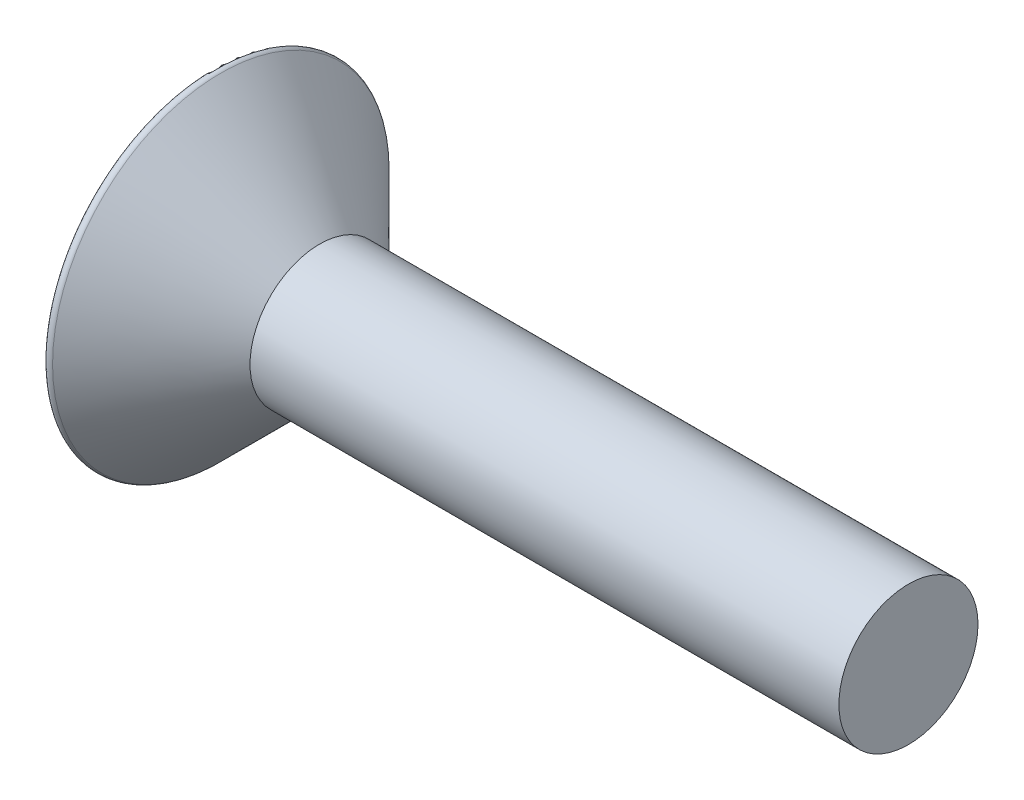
ISO-10303-21;
HEADER;
FILE_DESCRIPTION(('STEP AP214'),'2;1');
FILE_NAME('part.step','',(''),(''),'','','');
FILE_SCHEMA(('AUTOMOTIVE_DESIGN { 1 0 10303 214 1 1 1 1 }'));
ENDSEC;
DATA;
#1=APPLICATION_CONTEXT('core data for automotive mechanical design processes');
#2=APPLICATION_PROTOCOL_DEFINITION('international standard','automotive_design',2000,#1);
#3=PRODUCT_CONTEXT('',#1,'mechanical');
#4=PRODUCT('Part','Part','',(#3));
#5=PRODUCT_RELATED_PRODUCT_CATEGORY('part','',(#4));
#6=PRODUCT_DEFINITION_FORMATION('','',#4);
#7=PRODUCT_DEFINITION_CONTEXT('part definition',#1,'design');
#8=PRODUCT_DEFINITION('design','',#6,#7);
#9=PRODUCT_DEFINITION_SHAPE('','',#8);
#10=(LENGTH_UNIT() NAMED_UNIT(*) SI_UNIT(.MILLI.,.METRE.));
#11=(NAMED_UNIT(*) PLANE_ANGLE_UNIT() SI_UNIT($,.RADIAN.));
#12=(NAMED_UNIT(*) SI_UNIT($,.STERADIAN.) SOLID_ANGLE_UNIT());
#13=UNCERTAINTY_MEASURE_WITH_UNIT(LENGTH_MEASURE(1.E-05),#10,'distance_accuracy_value','');
#14=(GEOMETRIC_REPRESENTATION_CONTEXT(3) GLOBAL_UNCERTAINTY_ASSIGNED_CONTEXT((#13)) GLOBAL_UNIT_ASSIGNED_CONTEXT((#10,
#11,#12)) REPRESENTATION_CONTEXT('',''));
#15=CARTESIAN_POINT('',(0.,0.,0.));
#16=DIRECTION('',(0.,0.,1.));
#17=DIRECTION('',(1.,0.,0.));
#18=AXIS2_PLACEMENT_3D('',#15,#16,#17);
#19=CARTESIAN_POINT('',(0.,0.,0.));
#20=DIRECTION('',(1.,0.,0.));
#21=DIRECTION('',(0.,0.,-1.));
#22=AXIS2_PLACEMENT_3D('',#19,#20,#21);
#23=PLANE('',#22);
#24=CARTESIAN_POINT('',(0.,0.,0.));
#25=DIRECTION('',(1.,0.,0.));
#26=DIRECTION('',(0.,0.,-1.));
#27=AXIS2_PLACEMENT_3D('',#24,#25,#26);
#28=CIRCLE('',#27,7.1171572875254);
#29=CARTESIAN_POINT('',(0.,0.,-7.1171572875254));
#30=VERTEX_POINT('',#29);
#31=EDGE_CURVE('E11',#30,#30,#28,.F.);
#32=ORIENTED_EDGE('',*,*,#31,.T.);
#33=EDGE_LOOP('',(#32));
#34=FACE_BOUND('',#33,.T.);
#35=DIRECTION('',(0.,0.866025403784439,-0.5));
#36=VECTOR('',#35,1.);
#37=CARTESIAN_POINT('',(0.,-2.075,-1.19800180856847));
#38=LINE('',#37,#36);
#39=CARTESIAN_POINT('',(0.,-2.075,-1.19800180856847));
#40=VERTEX_POINT('',#39);
#41=CARTESIAN_POINT('',(0.,0.,-2.39600361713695));
#42=VERTEX_POINT('',#41);
#43=EDGE_CURVE('E52',#40,#42,#38,.T.);
#44=ORIENTED_EDGE('',*,*,#43,.T.);
#45=DIRECTION('',(0.,0.866025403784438,0.5));
#46=VECTOR('',#45,1.);
#47=CARTESIAN_POINT('',(0.,0.,-2.39600361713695));
#48=LINE('',#47,#46);
#49=CARTESIAN_POINT('',(0.,2.075,-1.19800180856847));
#50=VERTEX_POINT('',#49);
#51=EDGE_CURVE('E111',#42,#50,#48,.T.);
#52=ORIENTED_EDGE('',*,*,#51,.T.);
#53=DIRECTION('',(0.,0.,1.));
#54=VECTOR('',#53,1.);
#55=CARTESIAN_POINT('',(0.,2.075,-1.19800180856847));
#56=LINE('',#55,#54);
#57=CARTESIAN_POINT('',(0.,2.075,1.19800180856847));
#58=VERTEX_POINT('',#57);
#59=EDGE_CURVE('E109',#50,#58,#56,.T.);
#60=ORIENTED_EDGE('',*,*,#59,.T.);
#61=DIRECTION('',(0.,-0.866025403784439,0.5));
#62=VECTOR('',#61,1.);
#63=CARTESIAN_POINT('',(0.,2.075,1.19800180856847));
#64=LINE('',#63,#62);
#65=CARTESIAN_POINT('',(0.,0.,2.39600361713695));
#66=VERTEX_POINT('',#65);
#67=EDGE_CURVE('E88',#58,#66,#64,.T.);
#68=ORIENTED_EDGE('',*,*,#67,.T.);
#69=DIRECTION('',(0.,-0.866025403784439,-0.5));
#70=VECTOR('',#69,1.);
#71=CARTESIAN_POINT('',(0.,0.,2.39600361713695));
#72=LINE('',#71,#70);
#73=CARTESIAN_POINT('',(0.,-2.075,1.19800180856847));
#74=VERTEX_POINT('',#73);
#75=EDGE_CURVE('E99',#66,#74,#72,.T.);
#76=ORIENTED_EDGE('',*,*,#75,.T.);
#77=DIRECTION('',(0.,0.,-1.));
#78=VECTOR('',#77,1.);
#79=CARTESIAN_POINT('',(0.,-2.075,1.19800180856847));
#80=LINE('',#79,#78);
#81=EDGE_CURVE('E105',#74,#40,#80,.T.);
#82=ORIENTED_EDGE('',*,*,#81,.T.);
#83=EDGE_LOOP('',(#44,#52,#60,#68,#76,#82));
#84=FACE_BOUND('',#83,.T.);
#85=ADVANCED_FACE('F37',(#34,#84),#23,.F.);
#86=CARTESIAN_POINT('',(34.6,0.,0.));
#87=DIRECTION('',(-1.,0.,0.));
#88=DIRECTION('',(0.,0.,1.));
#89=AXIS2_PLACEMENT_3D('',#86,#87,#88);
#90=CYLINDRICAL_SURFACE('',#89,3.);
#91=CARTESIAN_POINT('',(4.6,0.,0.));
#92=DIRECTION('',(1.,0.,0.));
#93=DIRECTION('',(0.,0.,-1.));
#94=AXIS2_PLACEMENT_3D('',#91,#92,#93);
#95=CIRCLE('',#94,3.);
#96=CARTESIAN_POINT('',(4.6,0.,-3.));
#97=VERTEX_POINT('',#96);
#98=EDGE_CURVE('E126',#97,#97,#95,.T.);
#99=ORIENTED_EDGE('',*,*,#98,.T.);
#100=EDGE_LOOP('',(#99));
#101=FACE_BOUND('',#100,.T.);
#102=CARTESIAN_POINT('',(30.,0.,0.));
#103=DIRECTION('',(1.,0.,0.));
#104=DIRECTION('',(0.,0.,-1.));
#105=AXIS2_PLACEMENT_3D('',#102,#103,#104);
#106=CIRCLE('',#105,3.);
#107=CARTESIAN_POINT('',(30.,0.,-3.));
#108=VERTEX_POINT('',#107);
#109=EDGE_CURVE('E130',#108,#108,#106,.T.);
#110=ORIENTED_EDGE('',*,*,#109,.F.);
#111=EDGE_LOOP('',(#110));
#112=FACE_BOUND('',#111,.T.);
#113=ADVANCED_FACE('F149',(#101,#112),#90,.T.);
#114=CARTESIAN_POINT('',(4.6,0.,0.));
#115=DIRECTION('',(-1.,0.,0.));
#116=DIRECTION('',(0.,0.,-1.));
#117=AXIS2_PLACEMENT_3D('',#114,#115,#116);
#118=CONICAL_SURFACE('',#117,3.,0.78539816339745);
#119=CARTESIAN_POINT('',(0.341421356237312,0.,0.));
#120=DIRECTION('',(-1.,0.,0.));
#121=DIRECTION('',(0.,0.,1.));
#122=AXIS2_PLACEMENT_3D('',#119,#120,#121);
#123=CIRCLE('',#122,7.25857864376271);
#124=CARTESIAN_POINT('',(0.341421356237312,0.,7.25857864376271));
#125=VERTEX_POINT('',#124);
#126=EDGE_CURVE('E45',#125,#125,#123,.F.);
#127=ORIENTED_EDGE('',*,*,#126,.T.);
#128=EDGE_LOOP('',(#127));
#129=FACE_BOUND('',#128,.T.);
#130=ORIENTED_EDGE('',*,*,#98,.F.);
#131=EDGE_LOOP('',(#130));
#132=FACE_BOUND('',#131,.T.);
#133=ADVANCED_FACE('F135',(#129,#132),#118,.T.);
#134=CARTESIAN_POINT('',(30.,6.,60.4172122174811));
#135=DIRECTION('',(1.,0.,0.));
#136=DIRECTION('',(0.,0.,-1.));
#137=AXIS2_PLACEMENT_3D('',#134,#135,#136);
#138=PLANE('',#137);
#139=ORIENTED_EDGE('',*,*,#109,.T.);
#140=EDGE_LOOP('',(#139));
#141=FACE_BOUND('',#140,.T.);
#142=ADVANCED_FACE('F159',(#141),#138,.T.);
#143=CARTESIAN_POINT('',(2.,-2.075,-1.19800180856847));
#144=DIRECTION('',(0.,0.5,0.866025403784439));
#145=DIRECTION('',(0.,-0.866025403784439,0.5));
#146=AXIS2_PLACEMENT_3D('',#143,#144,#145);
#147=PLANE('',#146);
#148=ORIENTED_EDGE('',*,*,#43,.F.);
#149=DIRECTION('',(-1.,0.,0.));
#150=VECTOR('',#149,1.);
#151=CARTESIAN_POINT('',(2.,-2.075,-1.19800180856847));
#152=LINE('',#151,#150);
#153=CARTESIAN_POINT('',(2.,-2.075,-1.19800180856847));
#154=VERTEX_POINT('',#153);
#155=EDGE_CURVE('E117',#154,#40,#152,.T.);
#156=ORIENTED_EDGE('',*,*,#155,.F.);
#157=DIRECTION('',(0.,0.866025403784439,-0.5));
#158=VECTOR('',#157,1.);
#159=CARTESIAN_POINT('',(2.,-2.075,-1.19800180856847));
#160=LINE('',#159,#158);
#161=CARTESIAN_POINT('',(2.,0.,-2.39600361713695));
#162=VERTEX_POINT('',#161);
#163=EDGE_CURVE('E116',#154,#162,#160,.T.);
#164=ORIENTED_EDGE('',*,*,#163,.T.);
#165=DIRECTION('',(-1.,0.,0.));
#166=VECTOR('',#165,1.);
#167=CARTESIAN_POINT('',(2.,0.,-2.39600361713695));
#168=LINE('',#167,#166);
#169=EDGE_CURVE('E124',#162,#42,#168,.T.);
#170=ORIENTED_EDGE('',*,*,#169,.T.);
#171=EDGE_LOOP('',(#148,#156,#164,#170));
#172=FACE_BOUND('',#171,.T.);
#173=ADVANCED_FACE('F163',(#172),#147,.T.);
#174=CARTESIAN_POINT('',(2.,0.,-2.39600361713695));
#175=DIRECTION('',(0.,-0.5,0.866025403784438));
#176=DIRECTION('',(0.,-0.866025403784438,-0.5));
#177=AXIS2_PLACEMENT_3D('',#174,#175,#176);
#178=PLANE('',#177);
#179=ORIENTED_EDGE('',*,*,#51,.F.);
#180=ORIENTED_EDGE('',*,*,#169,.F.);
#181=DIRECTION('',(0.,0.866025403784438,0.5));
#182=VECTOR('',#181,1.);
#183=CARTESIAN_POINT('',(2.,0.,-2.39600361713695));
#184=LINE('',#183,#182);
#185=CARTESIAN_POINT('',(2.,2.075,-1.19800180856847));
#186=VERTEX_POINT('',#185);
#187=EDGE_CURVE('E209',#162,#186,#184,.T.);
#188=ORIENTED_EDGE('',*,*,#187,.T.);
#189=DIRECTION('',(-1.,0.,0.));
#190=VECTOR('',#189,1.);
#191=CARTESIAN_POINT('',(2.,2.075,-1.19800180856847));
#192=LINE('',#191,#190);
#193=EDGE_CURVE('E122',#186,#50,#192,.T.);
#194=ORIENTED_EDGE('',*,*,#193,.T.);
#195=EDGE_LOOP('',(#179,#180,#188,#194));
#196=FACE_BOUND('',#195,.T.);
#197=ADVANCED_FACE('F168',(#196),#178,.T.);
#198=CARTESIAN_POINT('',(2.,2.075,-1.19800180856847));
#199=DIRECTION('',(0.,-1.,0.));
#200=DIRECTION('',(0.,0.,-1.));
#201=AXIS2_PLACEMENT_3D('',#198,#199,#200);
#202=PLANE('',#201);
#203=ORIENTED_EDGE('',*,*,#59,.F.);
#204=ORIENTED_EDGE('',*,*,#193,.F.);
#205=DIRECTION('',(0.,0.,1.));
#206=VECTOR('',#205,1.);
#207=CARTESIAN_POINT('',(2.,2.075,-1.19800180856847));
#208=LINE('',#207,#206);
#209=CARTESIAN_POINT('',(2.,2.075,1.19800180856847));
#210=VERTEX_POINT('',#209);
#211=EDGE_CURVE('E61',#186,#210,#208,.T.);
#212=ORIENTED_EDGE('',*,*,#211,.T.);
#213=DIRECTION('',(-1.,0.,0.));
#214=VECTOR('',#213,1.);
#215=CARTESIAN_POINT('',(2.,2.075,1.19800180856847));
#216=LINE('',#215,#214);
#217=EDGE_CURVE('E95',#210,#58,#216,.T.);
#218=ORIENTED_EDGE('',*,*,#217,.T.);
#219=EDGE_LOOP('',(#203,#204,#212,#218));
#220=FACE_BOUND('',#219,.T.);
#221=ADVANCED_FACE('F173',(#220),#202,.T.);
#222=CARTESIAN_POINT('',(2.,2.075,1.19800180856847));
#223=DIRECTION('',(0.,-0.5,-0.866025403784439));
#224=DIRECTION('',(0.,0.866025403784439,-0.5));
#225=AXIS2_PLACEMENT_3D('',#222,#223,#224);
#226=PLANE('',#225);
#227=ORIENTED_EDGE('',*,*,#67,.F.);
#228=ORIENTED_EDGE('',*,*,#217,.F.);
#229=DIRECTION('',(0.,-0.866025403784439,0.5));
#230=VECTOR('',#229,1.);
#231=CARTESIAN_POINT('',(2.,2.075,1.19800180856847));
#232=LINE('',#231,#230);
#233=CARTESIAN_POINT('',(2.,0.,2.39600361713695));
#234=VERTEX_POINT('',#233);
#235=EDGE_CURVE('E92',#210,#234,#232,.T.);
#236=ORIENTED_EDGE('',*,*,#235,.T.);
#237=DIRECTION('',(-1.,0.,0.));
#238=VECTOR('',#237,1.);
#239=CARTESIAN_POINT('',(2.,0.,2.39600361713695));
#240=LINE('',#239,#238);
#241=EDGE_CURVE('E83',#234,#66,#240,.T.);
#242=ORIENTED_EDGE('',*,*,#241,.T.);
#243=EDGE_LOOP('',(#227,#228,#236,#242));
#244=FACE_BOUND('',#243,.T.);
#245=ADVANCED_FACE('F85',(#244),#226,.T.);
#246=CARTESIAN_POINT('',(2.,0.,2.39600361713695));
#247=DIRECTION('',(0.,0.5,-0.866025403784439));
#248=DIRECTION('',(0.,0.866025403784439,0.5));
#249=AXIS2_PLACEMENT_3D('',#246,#247,#248);
#250=PLANE('',#249);
#251=ORIENTED_EDGE('',*,*,#75,.F.);
#252=ORIENTED_EDGE('',*,*,#241,.F.);
#253=DIRECTION('',(0.,-0.866025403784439,-0.5));
#254=VECTOR('',#253,1.);
#255=CARTESIAN_POINT('',(2.,0.,2.39600361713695));
#256=LINE('',#255,#254);
#257=CARTESIAN_POINT('',(2.,-2.075,1.19800180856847));
#258=VERTEX_POINT('',#257);
#259=EDGE_CURVE('E226',#234,#258,#256,.T.);
#260=ORIENTED_EDGE('',*,*,#259,.T.);
#261=DIRECTION('',(-1.,0.,0.));
#262=VECTOR('',#261,1.);
#263=CARTESIAN_POINT('',(2.,-2.075,1.19800180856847));
#264=LINE('',#263,#262);
#265=EDGE_CURVE('E96',#258,#74,#264,.T.);
#266=ORIENTED_EDGE('',*,*,#265,.T.);
#267=EDGE_LOOP('',(#251,#252,#260,#266));
#268=FACE_BOUND('',#267,.T.);
#269=ADVANCED_FACE('F100',(#268),#250,.T.);
#270=CARTESIAN_POINT('',(2.,-2.075,1.19800180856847));
#271=DIRECTION('',(0.,1.,0.));
#272=DIRECTION('',(0.,0.,1.));
#273=AXIS2_PLACEMENT_3D('',#270,#271,#272);
#274=PLANE('',#273);
#275=ORIENTED_EDGE('',*,*,#81,.F.);
#276=ORIENTED_EDGE('',*,*,#265,.F.);
#277=DIRECTION('',(0.,0.,-1.));
#278=VECTOR('',#277,1.);
#279=CARTESIAN_POINT('',(2.,-2.075,1.19800180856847));
#280=LINE('',#279,#278);
#281=EDGE_CURVE('E119',#258,#154,#280,.T.);
#282=ORIENTED_EDGE('',*,*,#281,.T.);
#283=ORIENTED_EDGE('',*,*,#155,.T.);
#284=EDGE_LOOP('',(#275,#276,#282,#283));
#285=FACE_BOUND('',#284,.T.);
#286=ADVANCED_FACE('F182',(#285),#274,.T.);
#287=CARTESIAN_POINT('',(2.,0.,-2.39600361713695));
#288=DIRECTION('',(0.86602540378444,0.249999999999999,-0.433012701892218));
#289=DIRECTION('',(-0.447213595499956,0.,-0.894427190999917));
#290=AXIS2_PLACEMENT_3D('',#287,#288,#289);
#291=PLANE('',#290);
#292=ORIENTED_EDGE('',*,*,#187,.F.);
#293=DIRECTION('',(-0.447213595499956,0.,-0.894427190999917));
#294=VECTOR('',#293,1.);
#295=CARTESIAN_POINT('',(2.,0.,-2.39600361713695));
#296=LINE('',#295,#294);
#297=CARTESIAN_POINT('',(3.19800180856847,0.,0.));
#298=VERTEX_POINT('',#297);
#299=EDGE_CURVE('E212',#298,#162,#296,.T.);
#300=ORIENTED_EDGE('',*,*,#299,.F.);
#301=DIRECTION('',(-0.447213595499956,0.774596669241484,-0.447213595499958));
#302=VECTOR('',#301,1.);
#303=CARTESIAN_POINT('',(2.,2.075,-1.19800180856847));
#304=LINE('',#303,#302);
#305=EDGE_CURVE('E213',#298,#186,#304,.T.);
#306=ORIENTED_EDGE('',*,*,#305,.T.);
#307=EDGE_LOOP('',(#292,#300,#306));
#308=FACE_BOUND('',#307,.T.);
#309=ADVANCED_FACE('F185',(#308),#291,.F.);
#310=CARTESIAN_POINT('',(2.,2.075,-1.19800180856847));
#311=DIRECTION('',(0.86602540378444,0.499999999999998,0.));
#312=DIRECTION('',(-0.499999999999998,0.86602540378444,0.));
#313=AXIS2_PLACEMENT_3D('',#310,#311,#312);
#314=PLANE('',#313);
#315=ORIENTED_EDGE('',*,*,#211,.F.);
#316=ORIENTED_EDGE('',*,*,#305,.F.);
#317=DIRECTION('',(-0.447213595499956,0.774596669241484,0.447213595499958));
#318=VECTOR('',#317,1.);
#319=CARTESIAN_POINT('',(2.,2.075,1.19800180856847));
#320=LINE('',#319,#318);
#321=EDGE_CURVE('E230',#298,#210,#320,.T.);
#322=ORIENTED_EDGE('',*,*,#321,.T.);
#323=EDGE_LOOP('',(#315,#316,#322));
#324=FACE_BOUND('',#323,.T.);
#325=ADVANCED_FACE('F187',(#324),#314,.F.);
#326=CARTESIAN_POINT('',(2.,2.075,1.19800180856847));
#327=DIRECTION('',(0.86602540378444,0.249999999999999,0.433012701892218));
#328=DIRECTION('',(0.447213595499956,0.,-0.894427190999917));
#329=AXIS2_PLACEMENT_3D('',#326,#327,#328);
#330=PLANE('',#329);
#331=ORIENTED_EDGE('',*,*,#235,.F.);
#332=ORIENTED_EDGE('',*,*,#321,.F.);
#333=DIRECTION('',(-0.447213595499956,0.,0.894427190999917));
#334=VECTOR('',#333,1.);
#335=CARTESIAN_POINT('',(2.,0.,2.39600361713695));
#336=LINE('',#335,#334);
#337=EDGE_CURVE('E232',#298,#234,#336,.T.);
#338=ORIENTED_EDGE('',*,*,#337,.T.);
#339=EDGE_LOOP('',(#331,#332,#338));
#340=FACE_BOUND('',#339,.T.);
#341=ADVANCED_FACE('F190',(#340),#330,.F.);
#342=CARTESIAN_POINT('',(2.,0.,2.39600361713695));
#343=DIRECTION('',(0.86602540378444,-0.249999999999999,0.433012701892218));
#344=DIRECTION('',(0.447213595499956,0.,-0.894427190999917));
#345=AXIS2_PLACEMENT_3D('',#342,#343,#344);
#346=PLANE('',#345);
#347=ORIENTED_EDGE('',*,*,#259,.F.);
#348=ORIENTED_EDGE('',*,*,#337,.F.);
#349=DIRECTION('',(-0.447213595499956,-0.774596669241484,0.447213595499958));
#350=VECTOR('',#349,1.);
#351=CARTESIAN_POINT('',(2.,-2.075,1.19800180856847));
#352=LINE('',#351,#350);
#353=EDGE_CURVE('E235',#298,#258,#352,.T.);
#354=ORIENTED_EDGE('',*,*,#353,.T.);
#355=EDGE_LOOP('',(#347,#348,#354));
#356=FACE_BOUND('',#355,.T.);
#357=ADVANCED_FACE('F193',(#356),#346,.F.);
#358=CARTESIAN_POINT('',(2.,-2.075,1.19800180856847));
#359=DIRECTION('',(0.86602540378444,-0.499999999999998,0.));
#360=DIRECTION('',(0.499999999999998,0.86602540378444,0.));
#361=AXIS2_PLACEMENT_3D('',#358,#359,#360);
#362=PLANE('',#361);
#363=ORIENTED_EDGE('',*,*,#281,.F.);
#364=ORIENTED_EDGE('',*,*,#353,.F.);
#365=DIRECTION('',(-0.447213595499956,-0.774596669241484,-0.447213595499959));
#366=VECTOR('',#365,1.);
#367=CARTESIAN_POINT('',(2.,-2.075,-1.19800180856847));
#368=LINE('',#367,#366);
#369=EDGE_CURVE('E238',#298,#154,#368,.T.);
#370=ORIENTED_EDGE('',*,*,#369,.T.);
#371=EDGE_LOOP('',(#363,#364,#370));
#372=FACE_BOUND('',#371,.T.);
#373=ADVANCED_FACE('F144',(#372),#362,.F.);
#374=CARTESIAN_POINT('',(2.,-2.075,-1.19800180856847));
#375=DIRECTION('',(0.86602540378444,-0.249999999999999,-0.433012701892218));
#376=DIRECTION('',(-0.447213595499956,0.,-0.894427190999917));
#377=AXIS2_PLACEMENT_3D('',#374,#375,#376);
#378=PLANE('',#377);
#379=ORIENTED_EDGE('',*,*,#163,.F.);
#380=ORIENTED_EDGE('',*,*,#369,.F.);
#381=ORIENTED_EDGE('',*,*,#299,.T.);
#382=EDGE_LOOP('',(#379,#380,#381));
#383=FACE_BOUND('',#382,.T.);
#384=ADVANCED_FACE('F139',(#383),#378,.F.);
#385=CARTESIAN_POINT('',(0.2,0.,0.));
#386=DIRECTION('',(1.,0.,0.));
#387=DIRECTION('',(0.,0.,-1.));
#388=AXIS2_PLACEMENT_3D('',#385,#386,#387);
#389=TOROIDAL_SURFACE('',#388,7.1171572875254,0.2);
#390=ORIENTED_EDGE('',*,*,#31,.F.);
#391=EDGE_LOOP('',(#390));
#392=FACE_BOUND('',#391,.T.);
#393=ORIENTED_EDGE('',*,*,#126,.F.);
#394=EDGE_LOOP('',(#393));
#395=FACE_BOUND('',#394,.T.);
#396=ADVANCED_FACE('F39',(#392,#395),#389,.T.);
#397=CLOSED_SHELL('',(#85,#113,#133,#142,#173,#197,#221,#245,#269,#286,#309,#325,#341,#357,#373,
#384,#396));
#398=MANIFOLD_SOLID_BREP('B2',#397);
#399=ADVANCED_BREP_SHAPE_REPRESENTATION('',(#18,#398),#14);
#400=SHAPE_DEFINITION_REPRESENTATION(#9,#399);
ENDSEC;
END-ISO-10303-21;
